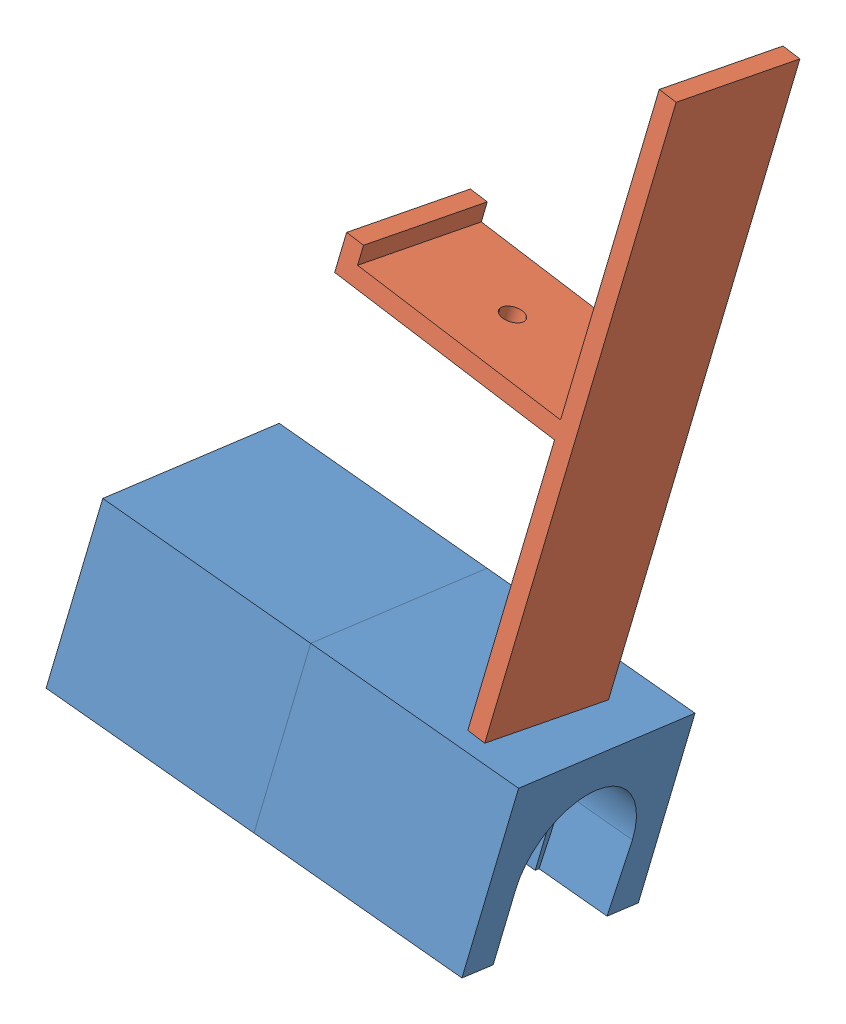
SolidWorks assembly Assem2.SLDASM, configuration Default (file format 9000). Lengths in mm.
Overall size (133.02 222.87 90.18).
3 component instances, 2 part files, 4 mates.
Components (placement in the parent):
- motor angle-1: motor angle.SLDPRT [Default] at (32.7679 -44.8915 -164.1143) x (-0.07626 -0.194607 -0.977912) z (0.987054 -0.153522 -0.046421) size (56.41 47.4 58)
- motor angle-2: motor angle.SLDPRT [Default] at (149.4312 -57.1752 -141.7364) x (0.07626 0.194607 0.977912) z (-0.987054 0.153522 0.046421) size (56.41 47.4 58)
- right-3: right.SLDPRT [Default] at (148.4395 31.9524 -189.0718) x (-0.014605 -0.203795 -0.978905) z (-0.989888 0.141098 -0.014605) size (37 160 70)
Mates (geometry in assembly coordinates):
- Coincident25: coincident anti-aligned: plane of motor angle-1 through (90.0009 -58.5764 -151.3386) normal (0.987054 -0.153522 -0.046421); plane of motor angle-2 through (90.0009 -58.5764 -151.3386) normal (-0.987054 0.153522 0.046421)
- Coincident28: coincident aligned: plane of motor angle-1 through (57.6977 -19.3546 -127.7817) normal (0.07626 0.194607 0.977912); plane of motor angle-2 through (134.6879 -31.3294 -131.4026) normal (0.07626 0.194607 0.977912)
- Coincident36: coincident aligned: plane of motor angle-1 through (57.6977 -19.3546 -127.7817) normal (0.141098 0.968793 -0.203795); plane of motor angle-2 through (130.386 -42.3075 -186.5684) normal (0.141098 0.968793 -0.203795)
- Coincident43: coincident anti-aligned: plane of motor angle-2 through (130.386 -42.3075 -186.5684) normal (0.141098 0.968793 -0.203795); plane of right-3 through (133.4481 -32.4611 -137.6407) normal (-0.141098 -0.968793 0.203795)
